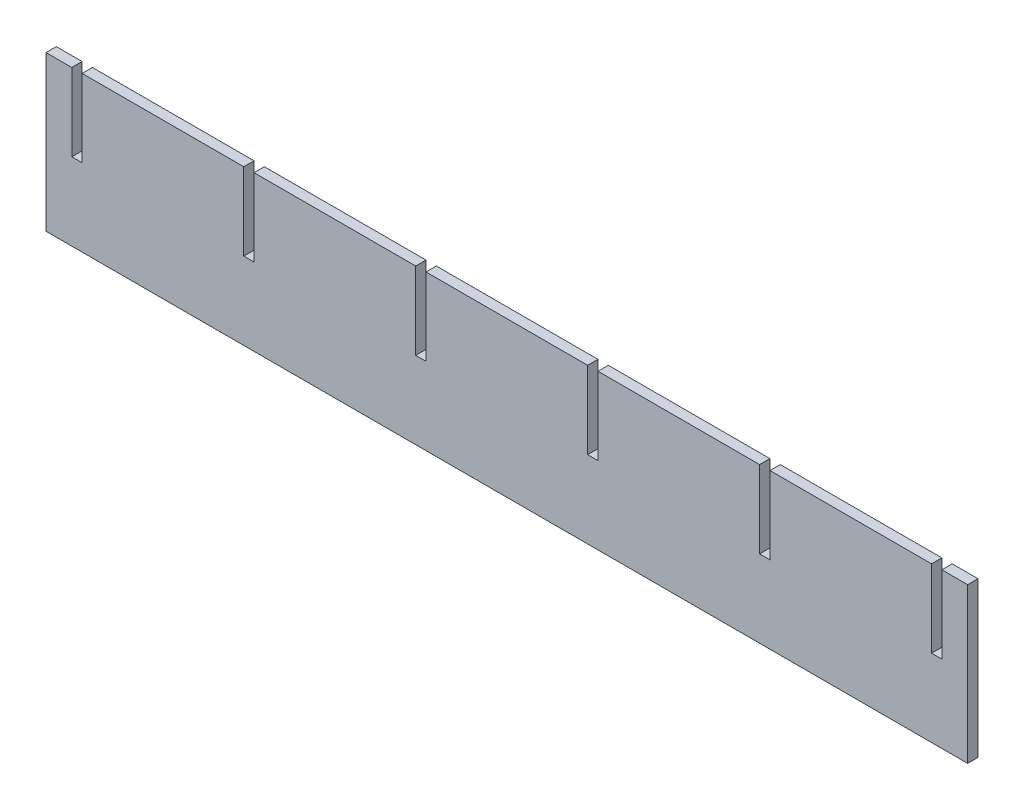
ISO-10303-21;
HEADER;
FILE_DESCRIPTION(('STEP AP214'),'2;1');
FILE_NAME('part.step','',(''),(''),'','','');
FILE_SCHEMA(('AUTOMOTIVE_DESIGN { 1 0 10303 214 1 1 1 1 }'));
ENDSEC;
DATA;
#1=APPLICATION_CONTEXT('core data for automotive mechanical design processes');
#2=APPLICATION_PROTOCOL_DEFINITION('international standard','automotive_design',2000,#1);
#3=PRODUCT_CONTEXT('',#1,'mechanical');
#4=PRODUCT('Part','Part','',(#3));
#5=PRODUCT_RELATED_PRODUCT_CATEGORY('part','',(#4));
#6=PRODUCT_DEFINITION_FORMATION('','',#4);
#7=PRODUCT_DEFINITION_CONTEXT('part definition',#1,'design');
#8=PRODUCT_DEFINITION('design','',#6,#7);
#9=PRODUCT_DEFINITION_SHAPE('','',#8);
#10=(LENGTH_UNIT() NAMED_UNIT(*) SI_UNIT(.MILLI.,.METRE.));
#11=(NAMED_UNIT(*) PLANE_ANGLE_UNIT() SI_UNIT($,.RADIAN.));
#12=(NAMED_UNIT(*) SI_UNIT($,.STERADIAN.) SOLID_ANGLE_UNIT());
#13=UNCERTAINTY_MEASURE_WITH_UNIT(LENGTH_MEASURE(1.E-05),#10,'distance_accuracy_value','');
#14=(GEOMETRIC_REPRESENTATION_CONTEXT(3) GLOBAL_UNCERTAINTY_ASSIGNED_CONTEXT((#13)) GLOBAL_UNIT_ASSIGNED_CONTEXT((#10,
#11,#12)) REPRESENTATION_CONTEXT('',''));
#15=CARTESIAN_POINT('',(0.,0.,0.));
#16=DIRECTION('',(0.,0.,1.));
#17=DIRECTION('',(1.,0.,0.));
#18=AXIS2_PLACEMENT_3D('',#15,#16,#17);
#19=CARTESIAN_POINT('',(0.,90.,12.));
#20=DIRECTION('',(0.,1.,0.));
#21=DIRECTION('',(-1.,0.,0.));
#22=AXIS2_PLACEMENT_3D('',#19,#20,#21);
#23=PLANE('',#22);
#24=DIRECTION('',(1.,0.,0.));
#25=VECTOR('',#24,1.);
#26=CARTESIAN_POINT('',(0.,90.,0.));
#27=LINE('',#26,#25);
#28=CARTESIAN_POINT('',(-494.,89.9999999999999,0.));
#29=VERTEX_POINT('',#28);
#30=CARTESIAN_POINT('',(-306.,90.,0.));
#31=VERTEX_POINT('',#30);
#32=EDGE_CURVE('E271',#29,#31,#27,.T.);
#33=ORIENTED_EDGE('',*,*,#32,.F.);
#34=DIRECTION('',(0.,0.,-1.));
#35=VECTOR('',#34,1.);
#36=CARTESIAN_POINT('',(-494.,89.9999999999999,12.));
#37=LINE('',#36,#35);
#38=CARTESIAN_POINT('',(-494.,89.9999999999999,12.));
#39=VERTEX_POINT('',#38);
#40=EDGE_CURVE('E11',#39,#29,#37,.T.);
#41=ORIENTED_EDGE('',*,*,#40,.F.);
#42=DIRECTION('',(1.,0.,0.));
#43=VECTOR('',#42,1.);
#44=CARTESIAN_POINT('',(0.,90.,12.));
#45=LINE('',#44,#43);
#46=CARTESIAN_POINT('',(-306.,90.,12.));
#47=VERTEX_POINT('',#46);
#48=EDGE_CURVE('E360',#39,#47,#45,.T.);
#49=ORIENTED_EDGE('',*,*,#48,.T.);
#50=DIRECTION('',(0.,0.,-1.));
#51=VECTOR('',#50,1.);
#52=CARTESIAN_POINT('',(-306.,90.,12.));
#53=LINE('',#52,#51);
#54=EDGE_CURVE('E67',#47,#31,#53,.T.);
#55=ORIENTED_EDGE('',*,*,#54,.T.);
#56=EDGE_LOOP('',(#33,#41,#49,#55));
#57=FACE_BOUND('',#56,.T.);
#58=ADVANCED_FACE('F49',(#57),#23,.T.);
#59=CARTESIAN_POINT('',(-494.,-6.09389082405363E-13,12.));
#60=DIRECTION('',(1.,0.,0.));
#61=DIRECTION('',(0.,1.,0.));
#62=AXIS2_PLACEMENT_3D('',#59,#60,#61);
#63=PLANE('',#62);
#64=DIRECTION('',(0.,-1.,0.));
#65=VECTOR('',#64,1.);
#66=CARTESIAN_POINT('',(-494.,-6.09389082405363E-13,0.));
#67=LINE('',#66,#65);
#68=CARTESIAN_POINT('',(-494.,0.,0.));
#69=VERTEX_POINT('',#68);
#70=EDGE_CURVE('E274',#29,#69,#67,.T.);
#71=ORIENTED_EDGE('',*,*,#70,.T.);
#72=DIRECTION('',(0.,0.,-1.));
#73=VECTOR('',#72,1.);
#74=CARTESIAN_POINT('',(-494.,0.,12.));
#75=LINE('',#74,#73);
#76=CARTESIAN_POINT('',(-494.,0.,12.));
#77=VERTEX_POINT('',#76);
#78=EDGE_CURVE('E59',#77,#69,#75,.T.);
#79=ORIENTED_EDGE('',*,*,#78,.F.);
#80=DIRECTION('',(0.,-1.,0.));
#81=VECTOR('',#80,1.);
#82=CARTESIAN_POINT('',(-494.,-6.09389082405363E-13,12.));
#83=LINE('',#82,#81);
#84=EDGE_CURVE('E457',#39,#77,#83,.T.);
#85=ORIENTED_EDGE('',*,*,#84,.F.);
#86=ORIENTED_EDGE('',*,*,#40,.T.);
#87=EDGE_LOOP('',(#71,#79,#85,#86));
#88=FACE_BOUND('',#87,.T.);
#89=ADVANCED_FACE('F51',(#88),#63,.F.);
#90=CARTESIAN_POINT('',(0.,0.,12.));
#91=DIRECTION('',(0.,1.,0.));
#92=DIRECTION('',(-1.,0.,0.));
#93=AXIS2_PLACEMENT_3D('',#90,#91,#92);
#94=PLANE('',#93);
#95=DIRECTION('',(1.,0.,0.));
#96=VECTOR('',#95,1.);
#97=CARTESIAN_POINT('',(0.,0.,0.));
#98=LINE('',#97,#96);
#99=CARTESIAN_POINT('',(-506.,0.,0.));
#100=VERTEX_POINT('',#99);
#101=EDGE_CURVE('E280',#100,#69,#98,.T.);
#102=ORIENTED_EDGE('',*,*,#101,.F.);
#103=DIRECTION('',(0.,0.,-1.));
#104=VECTOR('',#103,1.);
#105=CARTESIAN_POINT('',(-506.,0.,12.));
#106=LINE('',#105,#104);
#107=CARTESIAN_POINT('',(-506.,0.,12.));
#108=VERTEX_POINT('',#107);
#109=EDGE_CURVE('E431',#108,#100,#106,.T.);
#110=ORIENTED_EDGE('',*,*,#109,.F.);
#111=DIRECTION('',(1.,0.,0.));
#112=VECTOR('',#111,1.);
#113=CARTESIAN_POINT('',(0.,0.,12.));
#114=LINE('',#113,#112);
#115=EDGE_CURVE('E442',#108,#77,#114,.T.);
#116=ORIENTED_EDGE('',*,*,#115,.T.);
#117=ORIENTED_EDGE('',*,*,#78,.T.);
#118=EDGE_LOOP('',(#102,#110,#116,#117));
#119=FACE_BOUND('',#118,.T.);
#120=ADVANCED_FACE('F440',(#119),#94,.T.);
#121=CARTESIAN_POINT('',(-506.,6.24192056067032E-13,12.));
#122=DIRECTION('',(1.,0.,0.));
#123=DIRECTION('',(0.,1.,0.));
#124=AXIS2_PLACEMENT_3D('',#121,#122,#123);
#125=PLANE('',#124);
#126=DIRECTION('',(0.,-1.,0.));
#127=VECTOR('',#126,1.);
#128=CARTESIAN_POINT('',(-506.,6.24192056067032E-13,0.));
#129=LINE('',#128,#127);
#130=CARTESIAN_POINT('',(-506.,89.9999999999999,0.));
#131=VERTEX_POINT('',#130);
#132=EDGE_CURVE('E284',#131,#100,#129,.T.);
#133=ORIENTED_EDGE('',*,*,#132,.F.);
#134=DIRECTION('',(0.,0.,-1.));
#135=VECTOR('',#134,1.);
#136=CARTESIAN_POINT('',(-506.,89.9999999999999,12.));
#137=LINE('',#136,#135);
#138=CARTESIAN_POINT('',(-506.,89.9999999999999,12.));
#139=VERTEX_POINT('',#138);
#140=EDGE_CURVE('E428',#139,#131,#137,.T.);
#141=ORIENTED_EDGE('',*,*,#140,.F.);
#142=DIRECTION('',(0.,-1.,0.));
#143=VECTOR('',#142,1.);
#144=CARTESIAN_POINT('',(-506.,6.24192056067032E-13,12.));
#145=LINE('',#144,#143);
#146=EDGE_CURVE('E454',#139,#108,#145,.T.);
#147=ORIENTED_EDGE('',*,*,#146,.T.);
#148=ORIENTED_EDGE('',*,*,#109,.T.);
#149=EDGE_LOOP('',(#133,#141,#147,#148));
#150=FACE_BOUND('',#149,.T.);
#151=ADVANCED_FACE('F451',(#150),#125,.T.);
#152=CARTESIAN_POINT('',(-536.,89.9999999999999,0.));
#153=VERTEX_POINT('',#152);
#154=EDGE_CURVE('E276',#153,#131,#27,.T.);
#155=ORIENTED_EDGE('',*,*,#154,.F.);
#156=DIRECTION('',(0.,0.,-1.));
#157=VECTOR('',#156,1.);
#158=CARTESIAN_POINT('',(-536.,89.9999999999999,12.));
#159=LINE('',#158,#157);
#160=CARTESIAN_POINT('',(-536.,89.9999999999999,12.));
#161=VERTEX_POINT('',#160);
#162=EDGE_CURVE('E425',#161,#153,#159,.T.);
#163=ORIENTED_EDGE('',*,*,#162,.F.);
#164=EDGE_CURVE('E464',#161,#139,#45,.T.);
#165=ORIENTED_EDGE('',*,*,#164,.T.);
#166=ORIENTED_EDGE('',*,*,#140,.T.);
#167=EDGE_LOOP('',(#155,#163,#165,#166));
#168=FACE_BOUND('',#167,.T.);
#169=ADVANCED_FACE('F621',(#168),#23,.T.);
#170=CARTESIAN_POINT('',(-536.,0.,12.));
#171=DIRECTION('',(-1.,0.,0.));
#172=DIRECTION('',(0.,0.,1.));
#173=AXIS2_PLACEMENT_3D('',#170,#171,#172);
#174=PLANE('',#173);
#175=DIRECTION('',(0.,1.,0.));
#176=VECTOR('',#175,1.);
#177=CARTESIAN_POINT('',(-536.,0.,0.));
#178=LINE('',#177,#176);
#179=CARTESIAN_POINT('',(-536.,-90.0000000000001,0.));
#180=VERTEX_POINT('',#179);
#181=EDGE_CURVE('E288',#180,#153,#178,.T.);
#182=ORIENTED_EDGE('',*,*,#181,.F.);
#183=DIRECTION('',(0.,0.,-1.));
#184=VECTOR('',#183,1.);
#185=CARTESIAN_POINT('',(-536.,-90.0000000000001,12.));
#186=LINE('',#185,#184);
#187=CARTESIAN_POINT('',(-536.,-90.0000000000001,12.));
#188=VERTEX_POINT('',#187);
#189=EDGE_CURVE('E422',#188,#180,#186,.T.);
#190=ORIENTED_EDGE('',*,*,#189,.F.);
#191=DIRECTION('',(0.,1.,0.));
#192=VECTOR('',#191,1.);
#193=CARTESIAN_POINT('',(-536.,0.,12.));
#194=LINE('',#193,#192);
#195=EDGE_CURVE('E469',#188,#161,#194,.T.);
#196=ORIENTED_EDGE('',*,*,#195,.T.);
#197=ORIENTED_EDGE('',*,*,#162,.T.);
#198=EDGE_LOOP('',(#182,#190,#196,#197));
#199=FACE_BOUND('',#198,.T.);
#200=ADVANCED_FACE('F628',(#199),#174,.T.);
#201=CARTESIAN_POINT('',(0.,-90.,12.));
#202=DIRECTION('',(0.,1.,0.));
#203=DIRECTION('',(-1.,0.,0.));
#204=AXIS2_PLACEMENT_3D('',#201,#202,#203);
#205=PLANE('',#204);
#206=DIRECTION('',(1.,0.,0.));
#207=VECTOR('',#206,1.);
#208=CARTESIAN_POINT('',(0.,-90.,0.));
#209=LINE('',#208,#207);
#210=CARTESIAN_POINT('',(536.,-89.9999999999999,0.));
#211=VERTEX_POINT('',#210);
#212=EDGE_CURVE('E292',#180,#211,#209,.T.);
#213=ORIENTED_EDGE('',*,*,#212,.T.);
#214=DIRECTION('',(0.,0.,-1.));
#215=VECTOR('',#214,1.);
#216=CARTESIAN_POINT('',(536.,-89.9999999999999,12.));
#217=LINE('',#216,#215);
#218=CARTESIAN_POINT('',(536.,-89.9999999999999,12.));
#219=VERTEX_POINT('',#218);
#220=EDGE_CURVE('E418',#219,#211,#217,.T.);
#221=ORIENTED_EDGE('',*,*,#220,.F.);
#222=DIRECTION('',(1.,0.,0.));
#223=VECTOR('',#222,1.);
#224=CARTESIAN_POINT('',(0.,-90.,12.));
#225=LINE('',#224,#223);
#226=EDGE_CURVE('E473',#188,#219,#225,.T.);
#227=ORIENTED_EDGE('',*,*,#226,.F.);
#228=ORIENTED_EDGE('',*,*,#189,.T.);
#229=EDGE_LOOP('',(#213,#221,#227,#228));
#230=FACE_BOUND('',#229,.T.);
#231=ADVANCED_FACE('F799',(#230),#205,.F.);
#232=CARTESIAN_POINT('',(536.,0.,12.));
#233=DIRECTION('',(-1.,0.,0.));
#234=DIRECTION('',(0.,0.,1.));
#235=AXIS2_PLACEMENT_3D('',#232,#233,#234);
#236=PLANE('',#235);
#237=DIRECTION('',(0.,1.,0.));
#238=VECTOR('',#237,1.);
#239=CARTESIAN_POINT('',(536.,0.,0.));
#240=LINE('',#239,#238);
#241=CARTESIAN_POINT('',(536.,90.0000000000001,0.));
#242=VERTEX_POINT('',#241);
#243=EDGE_CURVE('E295',#211,#242,#240,.T.);
#244=ORIENTED_EDGE('',*,*,#243,.T.);
#245=DIRECTION('',(0.,0.,-1.));
#246=VECTOR('',#245,1.);
#247=CARTESIAN_POINT('',(536.,90.0000000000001,12.));
#248=LINE('',#247,#246);
#249=CARTESIAN_POINT('',(536.,90.0000000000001,12.));
#250=VERTEX_POINT('',#249);
#251=EDGE_CURVE('E415',#250,#242,#248,.T.);
#252=ORIENTED_EDGE('',*,*,#251,.F.);
#253=DIRECTION('',(0.,1.,0.));
#254=VECTOR('',#253,1.);
#255=CARTESIAN_POINT('',(536.,0.,12.));
#256=LINE('',#255,#254);
#257=EDGE_CURVE('E476',#219,#250,#256,.T.);
#258=ORIENTED_EDGE('',*,*,#257,.F.);
#259=ORIENTED_EDGE('',*,*,#220,.T.);
#260=EDGE_LOOP('',(#244,#252,#258,#259));
#261=FACE_BOUND('',#260,.T.);
#262=ADVANCED_FACE('F792',(#261),#236,.F.);
#263=CARTESIAN_POINT('',(506.,90.0000000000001,0.));
#264=VERTEX_POINT('',#263);
#265=EDGE_CURVE('E299',#264,#242,#27,.T.);
#266=ORIENTED_EDGE('',*,*,#265,.F.);
#267=DIRECTION('',(0.,0.,-1.));
#268=VECTOR('',#267,1.);
#269=CARTESIAN_POINT('',(506.,90.0000000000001,12.));
#270=LINE('',#269,#268);
#271=CARTESIAN_POINT('',(506.,90.0000000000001,12.));
#272=VERTEX_POINT('',#271);
#273=EDGE_CURVE('E412',#272,#264,#270,.T.);
#274=ORIENTED_EDGE('',*,*,#273,.F.);
#275=EDGE_CURVE('E479',#272,#250,#45,.T.);
#276=ORIENTED_EDGE('',*,*,#275,.T.);
#277=ORIENTED_EDGE('',*,*,#251,.T.);
#278=EDGE_LOOP('',(#266,#274,#276,#277));
#279=FACE_BOUND('',#278,.T.);
#280=ADVANCED_FACE('F629',(#279),#23,.T.);
#281=CARTESIAN_POINT('',(506.,6.24192056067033E-13,12.));
#282=DIRECTION('',(1.,0.,0.));
#283=DIRECTION('',(0.,1.,0.));
#284=AXIS2_PLACEMENT_3D('',#281,#282,#283);
#285=PLANE('',#284);
#286=DIRECTION('',(0.,-1.,0.));
#287=VECTOR('',#286,1.);
#288=CARTESIAN_POINT('',(506.,6.24192056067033E-13,0.));
#289=LINE('',#288,#287);
#290=CARTESIAN_POINT('',(506.,0.,0.));
#291=VERTEX_POINT('',#290);
#292=EDGE_CURVE('E300',#264,#291,#289,.T.);
#293=ORIENTED_EDGE('',*,*,#292,.T.);
#294=DIRECTION('',(0.,0.,-1.));
#295=VECTOR('',#294,1.);
#296=CARTESIAN_POINT('',(506.,0.,12.));
#297=LINE('',#296,#295);
#298=CARTESIAN_POINT('',(506.,0.,12.));
#299=VERTEX_POINT('',#298);
#300=EDGE_CURVE('E409',#299,#291,#297,.T.);
#301=ORIENTED_EDGE('',*,*,#300,.F.);
#302=DIRECTION('',(0.,-1.,0.));
#303=VECTOR('',#302,1.);
#304=CARTESIAN_POINT('',(506.,6.24192056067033E-13,12.));
#305=LINE('',#304,#303);
#306=EDGE_CURVE('E480',#272,#299,#305,.T.);
#307=ORIENTED_EDGE('',*,*,#306,.F.);
#308=ORIENTED_EDGE('',*,*,#273,.T.);
#309=EDGE_LOOP('',(#293,#301,#307,#308));
#310=FACE_BOUND('',#309,.T.);
#311=ADVANCED_FACE('F775',(#310),#285,.F.);
#312=CARTESIAN_POINT('',(0.,0.,12.));
#313=DIRECTION('',(0.,1.,0.));
#314=DIRECTION('',(-1.,0.,0.));
#315=AXIS2_PLACEMENT_3D('',#312,#313,#314);
#316=PLANE('',#315);
#317=DIRECTION('',(1.,0.,0.));
#318=VECTOR('',#317,1.);
#319=CARTESIAN_POINT('',(0.,0.,0.));
#320=LINE('',#319,#318);
#321=CARTESIAN_POINT('',(494.,0.,0.));
#322=VERTEX_POINT('',#321);
#323=EDGE_CURVE('E304',#322,#291,#320,.T.);
#324=ORIENTED_EDGE('',*,*,#323,.F.);
#325=DIRECTION('',(0.,0.,-1.));
#326=VECTOR('',#325,1.);
#327=CARTESIAN_POINT('',(494.,0.,12.));
#328=LINE('',#327,#326);
#329=CARTESIAN_POINT('',(494.,0.,12.));
#330=VERTEX_POINT('',#329);
#331=EDGE_CURVE('E406',#330,#322,#328,.T.);
#332=ORIENTED_EDGE('',*,*,#331,.F.);
#333=DIRECTION('',(1.,0.,0.));
#334=VECTOR('',#333,1.);
#335=CARTESIAN_POINT('',(0.,0.,12.));
#336=LINE('',#335,#334);
#337=EDGE_CURVE('E483',#330,#299,#336,.T.);
#338=ORIENTED_EDGE('',*,*,#337,.T.);
#339=ORIENTED_EDGE('',*,*,#300,.T.);
#340=EDGE_LOOP('',(#324,#332,#338,#339));
#341=FACE_BOUND('',#340,.T.);
#342=ADVANCED_FACE('F766',(#341),#316,.T.);
#343=CARTESIAN_POINT('',(494.,-6.09389082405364E-13,12.));
#344=DIRECTION('',(1.,0.,0.));
#345=DIRECTION('',(0.,1.,0.));
#346=AXIS2_PLACEMENT_3D('',#343,#344,#345);
#347=PLANE('',#346);
#348=DIRECTION('',(0.,-1.,0.));
#349=VECTOR('',#348,1.);
#350=CARTESIAN_POINT('',(494.,-6.09389082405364E-13,0.));
#351=LINE('',#350,#349);
#352=CARTESIAN_POINT('',(494.,90.0000000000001,0.));
#353=VERTEX_POINT('',#352);
#354=EDGE_CURVE('E308',#353,#322,#351,.T.);
#355=ORIENTED_EDGE('',*,*,#354,.F.);
#356=DIRECTION('',(0.,0.,-1.));
#357=VECTOR('',#356,1.);
#358=CARTESIAN_POINT('',(494.,90.0000000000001,12.));
#359=LINE('',#358,#357);
#360=CARTESIAN_POINT('',(494.,90.0000000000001,12.));
#361=VERTEX_POINT('',#360);
#362=EDGE_CURVE('E403',#361,#353,#359,.T.);
#363=ORIENTED_EDGE('',*,*,#362,.F.);
#364=DIRECTION('',(0.,-1.,0.));
#365=VECTOR('',#364,1.);
#366=CARTESIAN_POINT('',(494.,-6.09389082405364E-13,12.));
#367=LINE('',#366,#365);
#368=EDGE_CURVE('E487',#361,#330,#367,.T.);
#369=ORIENTED_EDGE('',*,*,#368,.T.);
#370=ORIENTED_EDGE('',*,*,#331,.T.);
#371=EDGE_LOOP('',(#355,#363,#369,#370));
#372=FACE_BOUND('',#371,.T.);
#373=ADVANCED_FACE('F759',(#372),#347,.T.);
#374=CARTESIAN_POINT('',(306.,90.,0.));
#375=VERTEX_POINT('',#374);
#376=EDGE_CURVE('E312',#375,#353,#27,.T.);
#377=ORIENTED_EDGE('',*,*,#376,.F.);
#378=DIRECTION('',(0.,0.,-1.));
#379=VECTOR('',#378,1.);
#380=CARTESIAN_POINT('',(306.,90.,12.));
#381=LINE('',#380,#379);
#382=CARTESIAN_POINT('',(306.,90.,12.));
#383=VERTEX_POINT('',#382);
#384=EDGE_CURVE('E400',#383,#375,#381,.T.);
#385=ORIENTED_EDGE('',*,*,#384,.F.);
#386=EDGE_CURVE('E491',#383,#361,#45,.T.);
#387=ORIENTED_EDGE('',*,*,#386,.T.);
#388=ORIENTED_EDGE('',*,*,#362,.T.);
#389=EDGE_LOOP('',(#377,#385,#387,#388));
#390=FACE_BOUND('',#389,.T.);
#391=ADVANCED_FACE('F618',(#390),#23,.T.);
#392=CARTESIAN_POINT('',(306.,3.77475828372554E-13,12.));
#393=DIRECTION('',(1.,0.,0.));
#394=DIRECTION('',(0.,1.,0.));
#395=AXIS2_PLACEMENT_3D('',#392,#393,#394);
#396=PLANE('',#395);
#397=DIRECTION('',(0.,-1.,0.));
#398=VECTOR('',#397,1.);
#399=CARTESIAN_POINT('',(306.,3.77475828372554E-13,0.));
#400=LINE('',#399,#398);
#401=CARTESIAN_POINT('',(306.,0.,0.));
#402=VERTEX_POINT('',#401);
#403=EDGE_CURVE('E313',#375,#402,#400,.T.);
#404=ORIENTED_EDGE('',*,*,#403,.T.);
#405=DIRECTION('',(0.,0.,-1.));
#406=VECTOR('',#405,1.);
#407=CARTESIAN_POINT('',(306.,0.,12.));
#408=LINE('',#407,#406);
#409=CARTESIAN_POINT('',(306.,0.,12.));
#410=VERTEX_POINT('',#409);
#411=EDGE_CURVE('E397',#410,#402,#408,.T.);
#412=ORIENTED_EDGE('',*,*,#411,.F.);
#413=DIRECTION('',(0.,-1.,0.));
#414=VECTOR('',#413,1.);
#415=CARTESIAN_POINT('',(306.,3.77475828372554E-13,12.));
#416=LINE('',#415,#414);
#417=EDGE_CURVE('E492',#383,#410,#416,.T.);
#418=ORIENTED_EDGE('',*,*,#417,.F.);
#419=ORIENTED_EDGE('',*,*,#384,.T.);
#420=EDGE_LOOP('',(#404,#412,#418,#419));
#421=FACE_BOUND('',#420,.T.);
#422=ADVANCED_FACE('F742',(#421),#396,.F.);
#423=CARTESIAN_POINT('',(0.,0.,12.));
#424=DIRECTION('',(0.,1.,0.));
#425=DIRECTION('',(-1.,0.,0.));
#426=AXIS2_PLACEMENT_3D('',#423,#424,#425);
#427=PLANE('',#426);
#428=DIRECTION('',(1.,0.,0.));
#429=VECTOR('',#428,1.);
#430=CARTESIAN_POINT('',(0.,0.,0.));
#431=LINE('',#430,#429);
#432=CARTESIAN_POINT('',(294.,0.,0.));
#433=VERTEX_POINT('',#432);
#434=EDGE_CURVE('E317',#433,#402,#431,.T.);
#435=ORIENTED_EDGE('',*,*,#434,.F.);
#436=DIRECTION('',(0.,0.,-1.));
#437=VECTOR('',#436,1.);
#438=CARTESIAN_POINT('',(294.,0.,12.));
#439=LINE('',#438,#437);
#440=CARTESIAN_POINT('',(294.,0.,12.));
#441=VERTEX_POINT('',#440);
#442=EDGE_CURVE('E394',#441,#433,#439,.T.);
#443=ORIENTED_EDGE('',*,*,#442,.F.);
#444=DIRECTION('',(1.,0.,0.));
#445=VECTOR('',#444,1.);
#446=CARTESIAN_POINT('',(0.,0.,12.));
#447=LINE('',#446,#445);
#448=EDGE_CURVE('E495',#441,#410,#447,.T.);
#449=ORIENTED_EDGE('',*,*,#448,.T.);
#450=ORIENTED_EDGE('',*,*,#411,.T.);
#451=EDGE_LOOP('',(#435,#443,#449,#450));
#452=FACE_BOUND('',#451,.T.);
#453=ADVANCED_FACE('F735',(#452),#427,.T.);
#454=CARTESIAN_POINT('',(294.,-3.62672854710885E-13,12.));
#455=DIRECTION('',(1.,0.,0.));
#456=DIRECTION('',(0.,1.,0.));
#457=AXIS2_PLACEMENT_3D('',#454,#455,#456);
#458=PLANE('',#457);
#459=DIRECTION('',(0.,-1.,0.));
#460=VECTOR('',#459,1.);
#461=CARTESIAN_POINT('',(294.,-3.62672854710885E-13,0.));
#462=LINE('',#461,#460);
#463=CARTESIAN_POINT('',(294.,90.,0.));
#464=VERTEX_POINT('',#463);
#465=EDGE_CURVE('E321',#464,#433,#462,.T.);
#466=ORIENTED_EDGE('',*,*,#465,.F.);
#467=DIRECTION('',(0.,0.,-1.));
#468=VECTOR('',#467,1.);
#469=CARTESIAN_POINT('',(294.,90.,12.));
#470=LINE('',#469,#468);
#471=CARTESIAN_POINT('',(294.,90.,12.));
#472=VERTEX_POINT('',#471);
#473=EDGE_CURVE('E391',#472,#464,#470,.T.);
#474=ORIENTED_EDGE('',*,*,#473,.F.);
#475=DIRECTION('',(0.,-1.,0.));
#476=VECTOR('',#475,1.);
#477=CARTESIAN_POINT('',(294.,-3.62672854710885E-13,12.));
#478=LINE('',#477,#476);
#479=EDGE_CURVE('E499',#472,#441,#478,.T.);
#480=ORIENTED_EDGE('',*,*,#479,.T.);
#481=ORIENTED_EDGE('',*,*,#442,.T.);
#482=EDGE_LOOP('',(#466,#474,#480,#481));
#483=FACE_BOUND('',#482,.T.);
#484=ADVANCED_FACE('F568',(#483),#458,.T.);
#485=CARTESIAN_POINT('',(106.,90.,0.));
#486=VERTEX_POINT('',#485);
#487=EDGE_CURVE('E325',#486,#464,#27,.T.);
#488=ORIENTED_EDGE('',*,*,#487,.F.);
#489=DIRECTION('',(0.,0.,-1.));
#490=VECTOR('',#489,1.);
#491=CARTESIAN_POINT('',(106.,90.,12.));
#492=LINE('',#491,#490);
#493=CARTESIAN_POINT('',(106.,90.,12.));
#494=VERTEX_POINT('',#493);
#495=EDGE_CURVE('E388',#494,#486,#492,.T.);
#496=ORIENTED_EDGE('',*,*,#495,.F.);
#497=EDGE_CURVE('E503',#494,#472,#45,.T.);
#498=ORIENTED_EDGE('',*,*,#497,.T.);
#499=ORIENTED_EDGE('',*,*,#473,.T.);
#500=EDGE_LOOP('',(#488,#496,#498,#499));
#501=FACE_BOUND('',#500,.T.);
#502=ADVANCED_FACE('F560',(#501),#23,.T.);
#503=CARTESIAN_POINT('',(106.,1.30759600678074E-13,12.));
#504=DIRECTION('',(1.,0.,0.));
#505=DIRECTION('',(0.,1.,0.));
#506=AXIS2_PLACEMENT_3D('',#503,#504,#505);
#507=PLANE('',#506);
#508=DIRECTION('',(0.,-1.,0.));
#509=VECTOR('',#508,1.);
#510=CARTESIAN_POINT('',(106.,1.30759600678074E-13,0.));
#511=LINE('',#510,#509);
#512=CARTESIAN_POINT('',(106.,0.,0.));
#513=VERTEX_POINT('',#512);
#514=EDGE_CURVE('E326',#486,#513,#511,.T.);
#515=ORIENTED_EDGE('',*,*,#514,.T.);
#516=DIRECTION('',(0.,0.,-1.));
#517=VECTOR('',#516,1.);
#518=CARTESIAN_POINT('',(106.,0.,12.));
#519=LINE('',#518,#517);
#520=CARTESIAN_POINT('',(106.,0.,12.));
#521=VERTEX_POINT('',#520);
#522=EDGE_CURVE('E385',#521,#513,#519,.T.);
#523=ORIENTED_EDGE('',*,*,#522,.F.);
#524=DIRECTION('',(0.,-1.,0.));
#525=VECTOR('',#524,1.);
#526=CARTESIAN_POINT('',(106.,1.30759600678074E-13,12.));
#527=LINE('',#526,#525);
#528=EDGE_CURVE('E504',#494,#521,#527,.T.);
#529=ORIENTED_EDGE('',*,*,#528,.F.);
#530=ORIENTED_EDGE('',*,*,#495,.T.);
#531=EDGE_LOOP('',(#515,#523,#529,#530));
#532=FACE_BOUND('',#531,.T.);
#533=ADVANCED_FACE('F609',(#532),#507,.F.);
#534=CARTESIAN_POINT('',(0.,0.,12.));
#535=DIRECTION('',(0.,1.,0.));
#536=DIRECTION('',(-1.,0.,0.));
#537=AXIS2_PLACEMENT_3D('',#534,#535,#536);
#538=PLANE('',#537);
#539=DIRECTION('',(1.,0.,0.));
#540=VECTOR('',#539,1.);
#541=CARTESIAN_POINT('',(0.,0.,0.));
#542=LINE('',#541,#540);
#543=CARTESIAN_POINT('',(94.0000000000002,0.,0.));
#544=VERTEX_POINT('',#543);
#545=EDGE_CURVE('E330',#544,#513,#542,.T.);
#546=ORIENTED_EDGE('',*,*,#545,.F.);
#547=DIRECTION('',(0.,0.,-1.));
#548=VECTOR('',#547,1.);
#549=CARTESIAN_POINT('',(94.0000000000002,0.,12.));
#550=LINE('',#549,#548);
#551=CARTESIAN_POINT('',(94.0000000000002,0.,12.));
#552=VERTEX_POINT('',#551);
#553=EDGE_CURVE('E382',#552,#544,#550,.T.);
#554=ORIENTED_EDGE('',*,*,#553,.F.);
#555=DIRECTION('',(1.,0.,0.));
#556=VECTOR('',#555,1.);
#557=CARTESIAN_POINT('',(0.,0.,12.));
#558=LINE('',#557,#556);
#559=EDGE_CURVE('E507',#552,#521,#558,.T.);
#560=ORIENTED_EDGE('',*,*,#559,.T.);
#561=ORIENTED_EDGE('',*,*,#522,.T.);
#562=EDGE_LOOP('',(#546,#554,#560,#561));
#563=FACE_BOUND('',#562,.T.);
#564=ADVANCED_FACE('F607',(#563),#538,.T.);
#565=CARTESIAN_POINT('',(94.0000000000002,-1.15956627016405E-13,12.));
#566=DIRECTION('',(1.,0.,0.));
#567=DIRECTION('',(0.,1.,0.));
#568=AXIS2_PLACEMENT_3D('',#565,#566,#567);
#569=PLANE('',#568);
#570=DIRECTION('',(0.,-1.,0.));
#571=VECTOR('',#570,1.);
#572=CARTESIAN_POINT('',(94.0000000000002,-1.15956627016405E-13,0.));
#573=LINE('',#572,#571);
#574=CARTESIAN_POINT('',(94.0000000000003,90.,0.));
#575=VERTEX_POINT('',#574);
#576=EDGE_CURVE('E334',#575,#544,#573,.T.);
#577=ORIENTED_EDGE('',*,*,#576,.F.);
#578=DIRECTION('',(0.,0.,-1.));
#579=VECTOR('',#578,1.);
#580=CARTESIAN_POINT('',(94.0000000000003,90.,12.));
#581=LINE('',#580,#579);
#582=CARTESIAN_POINT('',(94.0000000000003,90.,12.));
#583=VERTEX_POINT('',#582);
#584=EDGE_CURVE('E379',#583,#575,#581,.T.);
#585=ORIENTED_EDGE('',*,*,#584,.F.);
#586=DIRECTION('',(0.,-1.,0.));
#587=VECTOR('',#586,1.);
#588=CARTESIAN_POINT('',(94.0000000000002,-1.15956627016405E-13,12.));
#589=LINE('',#588,#587);
#590=EDGE_CURVE('E511',#583,#552,#589,.T.);
#591=ORIENTED_EDGE('',*,*,#590,.T.);
#592=ORIENTED_EDGE('',*,*,#553,.T.);
#593=EDGE_LOOP('',(#577,#585,#591,#592));
#594=FACE_BOUND('',#593,.T.);
#595=ADVANCED_FACE('F604',(#594),#569,.T.);
#596=CARTESIAN_POINT('',(-94.,90.,0.));
#597=VERTEX_POINT('',#596);
#598=EDGE_CURVE('E338',#597,#575,#27,.T.);
#599=ORIENTED_EDGE('',*,*,#598,.F.);
#600=DIRECTION('',(0.,0.,-1.));
#601=VECTOR('',#600,1.);
#602=CARTESIAN_POINT('',(-94.,90.,12.));
#603=LINE('',#602,#601);
#604=CARTESIAN_POINT('',(-94.,90.,12.));
#605=VERTEX_POINT('',#604);
#606=EDGE_CURVE('E376',#605,#597,#603,.T.);
#607=ORIENTED_EDGE('',*,*,#606,.F.);
#608=EDGE_CURVE('E515',#605,#583,#45,.T.);
#609=ORIENTED_EDGE('',*,*,#608,.T.);
#610=ORIENTED_EDGE('',*,*,#584,.T.);
#611=EDGE_LOOP('',(#599,#607,#609,#610));
#612=FACE_BOUND('',#611,.T.);
#613=ADVANCED_FACE('F598',(#612),#23,.T.);
#614=CARTESIAN_POINT('',(-93.9999999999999,-1.15956627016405E-13,12.));
#615=DIRECTION('',(1.,0.,0.));
#616=DIRECTION('',(0.,1.,0.));
#617=AXIS2_PLACEMENT_3D('',#614,#615,#616);
#618=PLANE('',#617);
#619=DIRECTION('',(0.,-1.,0.));
#620=VECTOR('',#619,1.);
#621=CARTESIAN_POINT('',(-93.9999999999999,-1.15956627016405E-13,0.));
#622=LINE('',#621,#620);
#623=CARTESIAN_POINT('',(-93.9999999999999,0.,0.));
#624=VERTEX_POINT('',#623);
#625=EDGE_CURVE('E339',#597,#624,#622,.T.);
#626=ORIENTED_EDGE('',*,*,#625,.T.);
#627=DIRECTION('',(0.,0.,-1.));
#628=VECTOR('',#627,1.);
#629=CARTESIAN_POINT('',(-93.9999999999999,0.,12.));
#630=LINE('',#629,#628);
#631=CARTESIAN_POINT('',(-93.9999999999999,0.,12.));
#632=VERTEX_POINT('',#631);
#633=EDGE_CURVE('E373',#632,#624,#630,.T.);
#634=ORIENTED_EDGE('',*,*,#633,.F.);
#635=DIRECTION('',(0.,-1.,0.));
#636=VECTOR('',#635,1.);
#637=CARTESIAN_POINT('',(-93.9999999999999,-1.15956627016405E-13,12.));
#638=LINE('',#637,#636);
#639=EDGE_CURVE('E516',#605,#632,#638,.T.);
#640=ORIENTED_EDGE('',*,*,#639,.F.);
#641=ORIENTED_EDGE('',*,*,#606,.T.);
#642=EDGE_LOOP('',(#626,#634,#640,#641));
#643=FACE_BOUND('',#642,.T.);
#644=ADVANCED_FACE('F636',(#643),#618,.F.);
#645=CARTESIAN_POINT('',(0.,0.,12.));
#646=DIRECTION('',(0.,1.,0.));
#647=DIRECTION('',(-1.,0.,0.));
#648=AXIS2_PLACEMENT_3D('',#645,#646,#647);
#649=PLANE('',#648);
#650=DIRECTION('',(1.,0.,0.));
#651=VECTOR('',#650,1.);
#652=CARTESIAN_POINT('',(0.,0.,0.));
#653=LINE('',#652,#651);
#654=CARTESIAN_POINT('',(-106.,0.,0.));
#655=VERTEX_POINT('',#654);
#656=EDGE_CURVE('E343',#655,#624,#653,.T.);
#657=ORIENTED_EDGE('',*,*,#656,.F.);
#658=DIRECTION('',(0.,0.,-1.));
#659=VECTOR('',#658,1.);
#660=CARTESIAN_POINT('',(-106.,0.,12.));
#661=LINE('',#660,#659);
#662=CARTESIAN_POINT('',(-106.,0.,12.));
#663=VERTEX_POINT('',#662);
#664=EDGE_CURVE('E370',#663,#655,#661,.T.);
#665=ORIENTED_EDGE('',*,*,#664,.F.);
#666=DIRECTION('',(1.,0.,0.));
#667=VECTOR('',#666,1.);
#668=CARTESIAN_POINT('',(0.,0.,12.));
#669=LINE('',#668,#667);
#670=EDGE_CURVE('E519',#663,#632,#669,.T.);
#671=ORIENTED_EDGE('',*,*,#670,.T.);
#672=ORIENTED_EDGE('',*,*,#633,.T.);
#673=EDGE_LOOP('',(#657,#665,#671,#672));
#674=FACE_BOUND('',#673,.T.);
#675=ADVANCED_FACE('F594',(#674),#649,.T.);
#676=CARTESIAN_POINT('',(-106.,1.30759600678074E-13,12.));
#677=DIRECTION('',(1.,0.,0.));
#678=DIRECTION('',(0.,1.,0.));
#679=AXIS2_PLACEMENT_3D('',#676,#677,#678);
#680=PLANE('',#679);
#681=DIRECTION('',(0.,-1.,0.));
#682=VECTOR('',#681,1.);
#683=CARTESIAN_POINT('',(-106.,1.30759600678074E-13,0.));
#684=LINE('',#683,#682);
#685=CARTESIAN_POINT('',(-106.,90.,0.));
#686=VERTEX_POINT('',#685);
#687=EDGE_CURVE('E347',#686,#655,#684,.T.);
#688=ORIENTED_EDGE('',*,*,#687,.F.);
#689=DIRECTION('',(0.,0.,-1.));
#690=VECTOR('',#689,1.);
#691=CARTESIAN_POINT('',(-106.,90.,12.));
#692=LINE('',#691,#690);
#693=CARTESIAN_POINT('',(-106.,90.,12.));
#694=VERTEX_POINT('',#693);
#695=EDGE_CURVE('E367',#694,#686,#692,.T.);
#696=ORIENTED_EDGE('',*,*,#695,.F.);
#697=DIRECTION('',(0.,-1.,0.));
#698=VECTOR('',#697,1.);
#699=CARTESIAN_POINT('',(-106.,1.30759600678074E-13,12.));
#700=LINE('',#699,#698);
#701=EDGE_CURVE('E522',#694,#663,#700,.T.);
#702=ORIENTED_EDGE('',*,*,#701,.T.);
#703=ORIENTED_EDGE('',*,*,#664,.T.);
#704=EDGE_LOOP('',(#688,#696,#702,#703));
#705=FACE_BOUND('',#704,.T.);
#706=ADVANCED_FACE('F590',(#705),#680,.T.);
#707=CARTESIAN_POINT('',(-294.,90.,0.));
#708=VERTEX_POINT('',#707);
#709=EDGE_CURVE('E275',#708,#686,#27,.T.);
#710=ORIENTED_EDGE('',*,*,#709,.F.);
#711=DIRECTION('',(0.,0.,-1.));
#712=VECTOR('',#711,1.);
#713=CARTESIAN_POINT('',(-294.,90.,12.));
#714=LINE('',#713,#712);
#715=CARTESIAN_POINT('',(-294.,90.,12.));
#716=VERTEX_POINT('',#715);
#717=EDGE_CURVE('E259',#716,#708,#714,.T.);
#718=ORIENTED_EDGE('',*,*,#717,.F.);
#719=EDGE_CURVE('E247',#716,#694,#45,.T.);
#720=ORIENTED_EDGE('',*,*,#719,.T.);
#721=ORIENTED_EDGE('',*,*,#695,.T.);
#722=EDGE_LOOP('',(#710,#718,#720,#721));
#723=FACE_BOUND('',#722,.T.);
#724=ADVANCED_FACE('F589',(#723),#23,.T.);
#725=CARTESIAN_POINT('',(-294.,-3.62672854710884E-13,12.));
#726=DIRECTION('',(1.,0.,0.));
#727=DIRECTION('',(0.,1.,0.));
#728=AXIS2_PLACEMENT_3D('',#725,#726,#727);
#729=PLANE('',#728);
#730=DIRECTION('',(0.,-1.,0.));
#731=VECTOR('',#730,1.);
#732=CARTESIAN_POINT('',(-294.,-3.62672854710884E-13,0.));
#733=LINE('',#732,#731);
#734=CARTESIAN_POINT('',(-294.,0.,0.));
#735=VERTEX_POINT('',#734);
#736=EDGE_CURVE('E255',#708,#735,#733,.T.);
#737=ORIENTED_EDGE('',*,*,#736,.T.);
#738=DIRECTION('',(0.,0.,-1.));
#739=VECTOR('',#738,1.);
#740=CARTESIAN_POINT('',(-294.,0.,12.));
#741=LINE('',#740,#739);
#742=CARTESIAN_POINT('',(-294.,0.,12.));
#743=VERTEX_POINT('',#742);
#744=EDGE_CURVE('E252',#743,#735,#741,.T.);
#745=ORIENTED_EDGE('',*,*,#744,.F.);
#746=DIRECTION('',(0.,-1.,0.));
#747=VECTOR('',#746,1.);
#748=CARTESIAN_POINT('',(-294.,-3.62672854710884E-13,12.));
#749=LINE('',#748,#747);
#750=EDGE_CURVE('E238',#716,#743,#749,.T.);
#751=ORIENTED_EDGE('',*,*,#750,.F.);
#752=ORIENTED_EDGE('',*,*,#717,.T.);
#753=EDGE_LOOP('',(#737,#745,#751,#752));
#754=FACE_BOUND('',#753,.T.);
#755=ADVANCED_FACE('F253',(#754),#729,.F.);
#756=CARTESIAN_POINT('',(0.,0.,12.));
#757=DIRECTION('',(0.,1.,0.));
#758=DIRECTION('',(-1.,0.,0.));
#759=AXIS2_PLACEMENT_3D('',#756,#757,#758);
#760=PLANE('',#759);
#761=DIRECTION('',(1.,0.,0.));
#762=VECTOR('',#761,1.);
#763=CARTESIAN_POINT('',(0.,0.,0.));
#764=LINE('',#763,#762);
#765=CARTESIAN_POINT('',(-306.,0.,0.));
#766=VERTEX_POINT('',#765);
#767=EDGE_CURVE('E353',#766,#735,#764,.T.);
#768=ORIENTED_EDGE('',*,*,#767,.F.);
#769=DIRECTION('',(0.,0.,-1.));
#770=VECTOR('',#769,1.);
#771=CARTESIAN_POINT('',(-306.,0.,12.));
#772=LINE('',#771,#770);
#773=CARTESIAN_POINT('',(-306.,0.,12.));
#774=VERTEX_POINT('',#773);
#775=EDGE_CURVE('E152',#774,#766,#772,.T.);
#776=ORIENTED_EDGE('',*,*,#775,.F.);
#777=DIRECTION('',(1.,0.,0.));
#778=VECTOR('',#777,1.);
#779=CARTESIAN_POINT('',(0.,0.,12.));
#780=LINE('',#779,#778);
#781=EDGE_CURVE('E244',#774,#743,#780,.T.);
#782=ORIENTED_EDGE('',*,*,#781,.T.);
#783=ORIENTED_EDGE('',*,*,#744,.T.);
#784=EDGE_LOOP('',(#768,#776,#782,#783));
#785=FACE_BOUND('',#784,.T.);
#786=ADVANCED_FACE('F261',(#785),#760,.T.);
#787=CARTESIAN_POINT('',(-306.,3.77475828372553E-13,12.));
#788=DIRECTION('',(1.,0.,0.));
#789=DIRECTION('',(0.,1.,0.));
#790=AXIS2_PLACEMENT_3D('',#787,#788,#789);
#791=PLANE('',#790);
#792=DIRECTION('',(0.,-1.,0.));
#793=VECTOR('',#792,1.);
#794=CARTESIAN_POINT('',(-306.,3.77475828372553E-13,0.));
#795=LINE('',#794,#793);
#796=EDGE_CURVE('E356',#31,#766,#795,.T.);
#797=ORIENTED_EDGE('',*,*,#796,.F.);
#798=ORIENTED_EDGE('',*,*,#54,.F.);
#799=DIRECTION('',(0.,-1.,0.));
#800=VECTOR('',#799,1.);
#801=CARTESIAN_POINT('',(-306.,3.77475828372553E-13,12.));
#802=LINE('',#801,#800);
#803=EDGE_CURVE('E263',#47,#774,#802,.T.);
#804=ORIENTED_EDGE('',*,*,#803,.T.);
#805=ORIENTED_EDGE('',*,*,#775,.T.);
#806=EDGE_LOOP('',(#797,#798,#804,#805));
#807=FACE_BOUND('',#806,.T.);
#808=ADVANCED_FACE('F676',(#807),#791,.T.);
#809=CARTESIAN_POINT('',(0.,0.,12.));
#810=DIRECTION('',(0.,0.,1.));
#811=DIRECTION('',(1.,0.,0.));
#812=AXIS2_PLACEMENT_3D('',#809,#810,#811);
#813=PLANE('',#812);
#814=ORIENTED_EDGE('',*,*,#48,.F.);
#815=ORIENTED_EDGE('',*,*,#84,.T.);
#816=ORIENTED_EDGE('',*,*,#115,.F.);
#817=ORIENTED_EDGE('',*,*,#146,.F.);
#818=ORIENTED_EDGE('',*,*,#164,.F.);
#819=ORIENTED_EDGE('',*,*,#195,.F.);
#820=ORIENTED_EDGE('',*,*,#226,.T.);
#821=ORIENTED_EDGE('',*,*,#257,.T.);
#822=ORIENTED_EDGE('',*,*,#275,.F.);
#823=ORIENTED_EDGE('',*,*,#306,.T.);
#824=ORIENTED_EDGE('',*,*,#337,.F.);
#825=ORIENTED_EDGE('',*,*,#368,.F.);
#826=ORIENTED_EDGE('',*,*,#386,.F.);
#827=ORIENTED_EDGE('',*,*,#417,.T.);
#828=ORIENTED_EDGE('',*,*,#448,.F.);
#829=ORIENTED_EDGE('',*,*,#479,.F.);
#830=ORIENTED_EDGE('',*,*,#497,.F.);
#831=ORIENTED_EDGE('',*,*,#528,.T.);
#832=ORIENTED_EDGE('',*,*,#559,.F.);
#833=ORIENTED_EDGE('',*,*,#590,.F.);
#834=ORIENTED_EDGE('',*,*,#608,.F.);
#835=ORIENTED_EDGE('',*,*,#639,.T.);
#836=ORIENTED_EDGE('',*,*,#670,.F.);
#837=ORIENTED_EDGE('',*,*,#701,.F.);
#838=ORIENTED_EDGE('',*,*,#719,.F.);
#839=ORIENTED_EDGE('',*,*,#750,.T.);
#840=ORIENTED_EDGE('',*,*,#781,.F.);
#841=ORIENTED_EDGE('',*,*,#803,.F.);
#842=EDGE_LOOP('',(#814,#815,#816,#817,#818,#819,#820,#821,#822,#823,#824,#825,#826,#827,#828,
#829,#830,#831,#832,#833,#834,#835,#836,#837,#838,#839,#840,#841));
#843=FACE_BOUND('',#842,.T.);
#844=ADVANCED_FACE('F241',(#843),#813,.T.);
#845=CARTESIAN_POINT('',(0.,0.,0.));
#846=DIRECTION('',(0.,0.,1.));
#847=DIRECTION('',(1.,0.,0.));
#848=AXIS2_PLACEMENT_3D('',#845,#846,#847);
#849=PLANE('',#848);
#850=ORIENTED_EDGE('',*,*,#32,.T.);
#851=ORIENTED_EDGE('',*,*,#796,.T.);
#852=ORIENTED_EDGE('',*,*,#767,.T.);
#853=ORIENTED_EDGE('',*,*,#736,.F.);
#854=ORIENTED_EDGE('',*,*,#709,.T.);
#855=ORIENTED_EDGE('',*,*,#687,.T.);
#856=ORIENTED_EDGE('',*,*,#656,.T.);
#857=ORIENTED_EDGE('',*,*,#625,.F.);
#858=ORIENTED_EDGE('',*,*,#598,.T.);
#859=ORIENTED_EDGE('',*,*,#576,.T.);
#860=ORIENTED_EDGE('',*,*,#545,.T.);
#861=ORIENTED_EDGE('',*,*,#514,.F.);
#862=ORIENTED_EDGE('',*,*,#487,.T.);
#863=ORIENTED_EDGE('',*,*,#465,.T.);
#864=ORIENTED_EDGE('',*,*,#434,.T.);
#865=ORIENTED_EDGE('',*,*,#403,.F.);
#866=ORIENTED_EDGE('',*,*,#376,.T.);
#867=ORIENTED_EDGE('',*,*,#354,.T.);
#868=ORIENTED_EDGE('',*,*,#323,.T.);
#869=ORIENTED_EDGE('',*,*,#292,.F.);
#870=ORIENTED_EDGE('',*,*,#265,.T.);
#871=ORIENTED_EDGE('',*,*,#243,.F.);
#872=ORIENTED_EDGE('',*,*,#212,.F.);
#873=ORIENTED_EDGE('',*,*,#181,.T.);
#874=ORIENTED_EDGE('',*,*,#154,.T.);
#875=ORIENTED_EDGE('',*,*,#132,.T.);
#876=ORIENTED_EDGE('',*,*,#101,.T.);
#877=ORIENTED_EDGE('',*,*,#70,.F.);
#878=EDGE_LOOP('',(#850,#851,#852,#853,#854,#855,#856,#857,#858,#859,#860,#861,#862,#863,#864,
#865,#866,#867,#868,#869,#870,#871,#872,#873,#874,#875,#876,#877));
#879=FACE_BOUND('',#878,.T.);
#880=ADVANCED_FACE('F446',(#879),#849,.F.);
#881=CLOSED_SHELL('',(#58,#89,#120,#151,#169,#200,#231,#262,#280,#311,#342,#373,#391,#422,#453,
#484,#502,#533,#564,#595,#613,#644,#675,#706,#724,#755,#786,#808,#844,#880));
#882=MANIFOLD_SOLID_BREP('B2',#881);
#883=ADVANCED_BREP_SHAPE_REPRESENTATION('',(#18,#882),#14);
#884=SHAPE_DEFINITION_REPRESENTATION(#9,#883);
ENDSEC;
END-ISO-10303-21;
